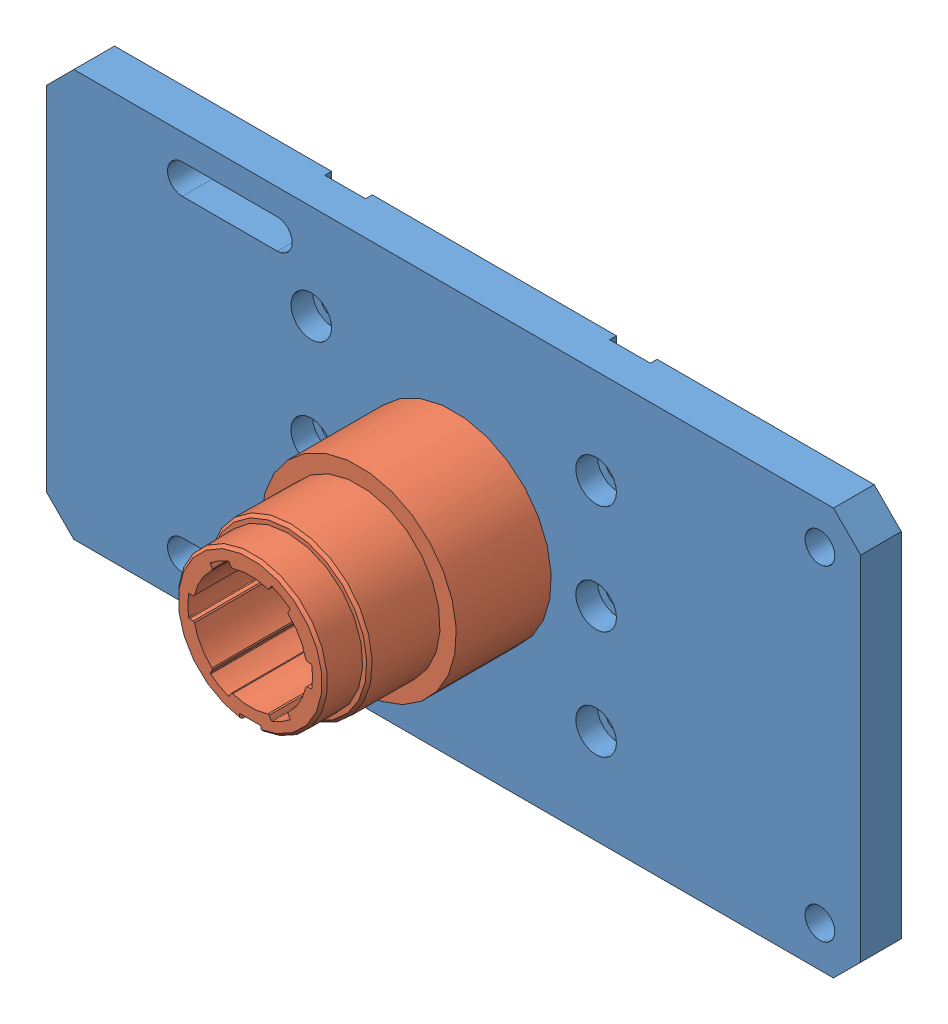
SolidWorks assembly fixe2.SLDASM, configuration Défaut (file format 5000). Lengths in mm.
Overall size (300 150 90).
2 component instances, 2 part files, 3 mates.
Components (placement in the parent):
- plaque de fixation-1: plaque de fixation.SLDPRT [Défaut] at origin size (300 150 15)
- moyeu cannelé-1: moyeu cannelé.SLDPRT [Défaut] at (0 0 5) x (0 1 0) z (0 0 1) size (72 72 85)
Mates (geometry in assembly coordinates):
- Coaxial1: concentric aligned: cylinder of plaque de fixation-1 through (0 0 15) axis (0 0 -1) radius 27.5; cylinder of moyeu cannelé-1 through (0 0 90) axis (0 0 -1) radius 27.5
- Coïncidente1: coincident anti-aligned: plane of plaque de fixation-1 through (150 75 15) normal (0 0 1); plane of moyeu cannelé-1 through (27 0 15) normal (0 0 -1)
- Coïncidente8: coincident anti-aligned: plane of assembly; plane of moyeu cannelé-1
